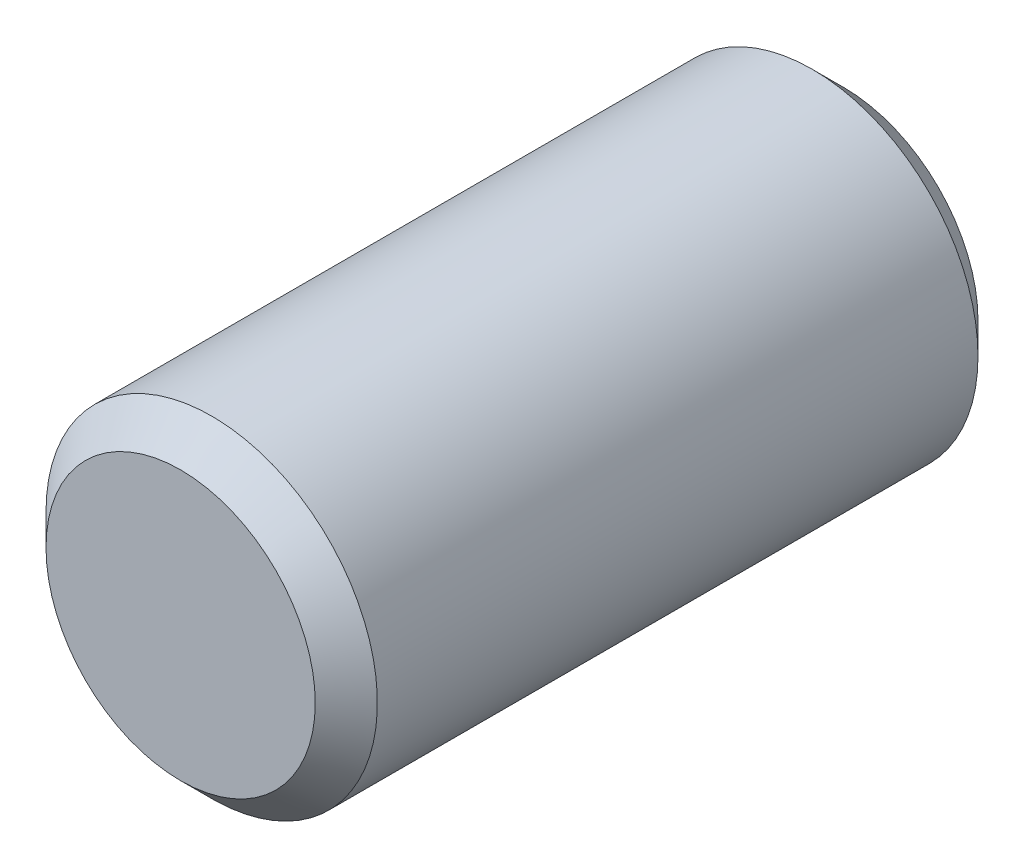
ISO-10303-21;
HEADER;
FILE_DESCRIPTION(('STEP AP214'),'2;1');
FILE_NAME('part.step','',(''),(''),'','','');
FILE_SCHEMA(('AUTOMOTIVE_DESIGN { 1 0 10303 214 1 1 1 1 }'));
ENDSEC;
DATA;
#1=APPLICATION_CONTEXT('core data for automotive mechanical design processes');
#2=APPLICATION_PROTOCOL_DEFINITION('international standard','automotive_design',2000,#1);
#3=PRODUCT_CONTEXT('',#1,'mechanical');
#4=PRODUCT('Part','Part','',(#3));
#5=PRODUCT_RELATED_PRODUCT_CATEGORY('part','',(#4));
#6=PRODUCT_DEFINITION_FORMATION('','',#4);
#7=PRODUCT_DEFINITION_CONTEXT('part definition',#1,'design');
#8=PRODUCT_DEFINITION('design','',#6,#7);
#9=PRODUCT_DEFINITION_SHAPE('','',#8);
#10=(LENGTH_UNIT() NAMED_UNIT(*) SI_UNIT(.MILLI.,.METRE.));
#11=(NAMED_UNIT(*) PLANE_ANGLE_UNIT() SI_UNIT($,.RADIAN.));
#12=(NAMED_UNIT(*) SI_UNIT($,.STERADIAN.) SOLID_ANGLE_UNIT());
#13=UNCERTAINTY_MEASURE_WITH_UNIT(LENGTH_MEASURE(1.E-05),#10,'distance_accuracy_value','');
#14=(GEOMETRIC_REPRESENTATION_CONTEXT(3) GLOBAL_UNCERTAINTY_ASSIGNED_CONTEXT((#13)) GLOBAL_UNIT_ASSIGNED_CONTEXT((#10,
#11,#12)) REPRESENTATION_CONTEXT('',''));
#15=CARTESIAN_POINT('',(0.,0.,0.));
#16=DIRECTION('',(0.,0.,1.));
#17=DIRECTION('',(1.,0.,0.));
#18=AXIS2_PLACEMENT_3D('',#15,#16,#17);
#19=CARTESIAN_POINT('',(0.,0.,32.));
#20=DIRECTION('',(0.,0.,-0.999999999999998));
#21=DIRECTION('',(-0.999999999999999,0.,0.));
#22=AXIS2_PLACEMENT_3D('',#19,#20,#21);
#23=CYLINDRICAL_SURFACE('',#22,8.);
#24=CARTESIAN_POINT('',(0.,0.,30.5));
#25=DIRECTION('',(0.,0.,0.999999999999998));
#26=DIRECTION('',(0.999999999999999,0.,0.));
#27=AXIS2_PLACEMENT_3D('',#24,#25,#26);
#28=CIRCLE('',#27,8.);
#29=CARTESIAN_POINT('',(-8.,0.,30.5));
#30=VERTEX_POINT('',#29);
#31=EDGE_CURVE('E42',#30,#30,#28,.F.);
#32=CARTESIAN_POINT('',(0.,0.,1.5));
#33=DIRECTION('',(0.,0.,0.999999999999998));
#34=DIRECTION('',(0.999999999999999,0.,0.));
#35=AXIS2_PLACEMENT_3D('',#32,#33,#34);
#36=CIRCLE('',#35,8.);
#37=CARTESIAN_POINT('',(-8.,0.,1.5));
#38=VERTEX_POINT('',#37);
#39=EDGE_CURVE('E46',#38,#38,#36,.T.);
#40=CARTESIAN_POINT('',(-8.,0.,30.5));
#41=CARTESIAN_POINT('',(-8.,0.,30.1979166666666));
#42=CARTESIAN_POINT('',(-8.,0.,29.8958333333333));
#43=CARTESIAN_POINT('',(-8.,0.,29.2916666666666));
#44=CARTESIAN_POINT('',(-8.,0.,28.9895833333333));
#45=CARTESIAN_POINT('',(-8.,0.,28.3854166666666));
#46=CARTESIAN_POINT('',(-8.,0.,28.0833333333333));
#47=CARTESIAN_POINT('',(-8.,0.,27.4791666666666));
#48=CARTESIAN_POINT('',(-8.,0.,27.1770833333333));
#49=CARTESIAN_POINT('',(-8.,0.,26.5729166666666));
#50=CARTESIAN_POINT('',(-8.,0.,26.2708333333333));
#51=CARTESIAN_POINT('',(-8.,0.,25.6666666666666));
#52=CARTESIAN_POINT('',(-8.,0.,25.3645833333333));
#53=CARTESIAN_POINT('',(-8.,0.,24.7604166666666));
#54=CARTESIAN_POINT('',(-8.,0.,24.4583333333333));
#55=CARTESIAN_POINT('',(-8.,0.,23.8541666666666));
#56=CARTESIAN_POINT('',(-8.,0.,23.5520833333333));
#57=CARTESIAN_POINT('',(-8.,0.,22.9479166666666));
#58=CARTESIAN_POINT('',(-8.,0.,22.6458333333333));
#59=CARTESIAN_POINT('',(-8.,0.,22.0416666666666));
#60=CARTESIAN_POINT('',(-8.,0.,21.7395833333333));
#61=CARTESIAN_POINT('',(-8.,0.,21.1354166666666));
#62=CARTESIAN_POINT('',(-8.,0.,20.8333333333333));
#63=CARTESIAN_POINT('',(-8.,0.,20.2291666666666));
#64=CARTESIAN_POINT('',(-8.,0.,19.9270833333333));
#65=CARTESIAN_POINT('',(-8.,0.,19.3229166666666));
#66=CARTESIAN_POINT('',(-8.,0.,19.0208333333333));
#67=CARTESIAN_POINT('',(-8.,0.,18.4166666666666));
#68=CARTESIAN_POINT('',(-8.,0.,18.1145833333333));
#69=CARTESIAN_POINT('',(-8.,0.,17.5104166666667));
#70=CARTESIAN_POINT('',(-8.,0.,17.2083333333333));
#71=CARTESIAN_POINT('',(-8.,0.,16.6041666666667));
#72=CARTESIAN_POINT('',(-8.,0.,16.3020833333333));
#73=CARTESIAN_POINT('',(-8.,0.,15.6979166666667));
#74=CARTESIAN_POINT('',(-8.,0.,15.3958333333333));
#75=CARTESIAN_POINT('',(-8.,0.,14.7916666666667));
#76=CARTESIAN_POINT('',(-8.,0.,14.4895833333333));
#77=CARTESIAN_POINT('',(-8.,0.,13.8854166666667));
#78=CARTESIAN_POINT('',(-8.,0.,13.5833333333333));
#79=CARTESIAN_POINT('',(-8.,0.,12.9791666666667));
#80=CARTESIAN_POINT('',(-8.,0.,12.6770833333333));
#81=CARTESIAN_POINT('',(-8.,0.,12.0729166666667));
#82=CARTESIAN_POINT('',(-8.,0.,11.7708333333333));
#83=CARTESIAN_POINT('',(-8.,0.,11.1666666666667));
#84=CARTESIAN_POINT('',(-8.,0.,10.8645833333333));
#85=CARTESIAN_POINT('',(-8.,0.,10.2604166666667));
#86=CARTESIAN_POINT('',(-8.,0.,9.95833333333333));
#87=CARTESIAN_POINT('',(-8.,0.,9.35416666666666));
#88=CARTESIAN_POINT('',(-8.,0.,9.05208333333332));
#89=CARTESIAN_POINT('',(-8.,0.,8.44791666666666));
#90=CARTESIAN_POINT('',(-8.,0.,8.14583333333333));
#91=CARTESIAN_POINT('',(-8.,0.,7.54166666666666));
#92=CARTESIAN_POINT('',(-8.,0.,7.23958333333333));
#93=CARTESIAN_POINT('',(-8.,0.,6.63541666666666));
#94=CARTESIAN_POINT('',(-8.,0.,6.33333333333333));
#95=CARTESIAN_POINT('',(-8.,0.,5.72916666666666));
#96=CARTESIAN_POINT('',(-8.,0.,5.42708333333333));
#97=CARTESIAN_POINT('',(-8.,0.,4.82291666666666));
#98=CARTESIAN_POINT('',(-8.,0.,4.52083333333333));
#99=CARTESIAN_POINT('',(-8.,0.,3.91666666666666));
#100=CARTESIAN_POINT('',(-8.,0.,3.61458333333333));
#101=CARTESIAN_POINT('',(-8.,0.,3.01041666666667));
#102=CARTESIAN_POINT('',(-8.,0.,2.70833333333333));
#103=CARTESIAN_POINT('',(-8.,0.,2.10416666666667));
#104=CARTESIAN_POINT('',(-8.,0.,1.80208333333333));
#105=CARTESIAN_POINT('',(-8.,0.,1.5));
#106=B_SPLINE_CURVE_WITH_KNOTS('',3,(#40,#41,#42,#43,#44,#45,#46,#47,#48,#49,#50,#51,#52,#53,
#54,#55,#56,#57,#58,#59,#60,#61,#62,#63,#64,#65,#66,#67,#68,#69,#70,#71,#72,#73,#74,#75,#76,#77,
#78,#79,#80,#81,#82,#83,#84,#85,#86,#87,#88,#89,#90,#91,#92,#93,#94,#95,#96,#97,#98,#99,#100,
#101,#102,#103,#104,#105),.UNSPECIFIED.,.F.,.F.,(4,2,2,2,2,2,2,2,2,2,2,2,2,2,2,2,2,2,2,2,2,2,2,
2,2,2,2,2,2,2,2,2,4),(0.,0.906250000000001,1.8125,2.71875,3.625,4.53125,5.4375,6.34375,
7.24999999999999,8.15625,9.06249999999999,9.96874999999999,10.875,11.78125,12.6875,13.59375,
14.5,15.40625,16.3125,17.21875,18.125,19.03125,19.9375,20.84375,21.75,22.65625,23.5625,24.46875,
25.375,26.28125,27.1875,28.09375,29.),.UNSPECIFIED.);
#107=EDGE_CURVE('BSEAM36',#30,#38,#106,.T.);
#108=ORIENTED_EDGE('',*,*,#31,.T.);
#109=ORIENTED_EDGE('',*,*,#39,.T.);
#110=ORIENTED_EDGE('',*,*,#107,.T.);
#111=ORIENTED_EDGE('',*,*,#107,.F.);
#112=EDGE_LOOP('',(#108,#110,#109,#111));
#113=FACE_BOUND('',#112,.T.);
#114=ADVANCED_FACE('F36',(#113),#23,.T.);
#115=CARTESIAN_POINT('',(0.,0.,32.));
#116=DIRECTION('',(0.,0.,0.999999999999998));
#117=DIRECTION('',(0.999999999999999,0.,0.));
#118=AXIS2_PLACEMENT_3D('',#115,#116,#117);
#119=PLANE('',#118);
#120=CARTESIAN_POINT('',(0.,0.,32.));
#121=DIRECTION('',(0.,0.,0.999999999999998));
#122=DIRECTION('',(0.999999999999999,0.,0.));
#123=AXIS2_PLACEMENT_3D('',#120,#121,#122);
#124=CIRCLE('',#123,6.5);
#125=CARTESIAN_POINT('',(-6.5,0.,32.));
#126=VERTEX_POINT('',#125);
#127=EDGE_CURVE('E50',#126,#126,#124,.T.);
#128=ORIENTED_EDGE('',*,*,#127,.T.);
#129=EDGE_LOOP('',(#128));
#130=FACE_BOUND('',#129,.T.);
#131=ADVANCED_FACE('F56',(#130),#119,.T.);
#132=CARTESIAN_POINT('',(0.,0.,0.));
#133=DIRECTION('',(0.,0.,0.999999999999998));
#134=DIRECTION('',(0.999999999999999,0.,0.));
#135=AXIS2_PLACEMENT_3D('',#132,#133,#134);
#136=PLANE('',#135);
#137=CARTESIAN_POINT('',(0.,0.,0.));
#138=DIRECTION('',(0.,0.,0.999999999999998));
#139=DIRECTION('',(0.999999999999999,0.,0.));
#140=AXIS2_PLACEMENT_3D('',#137,#138,#139);
#141=CIRCLE('',#140,6.5);
#142=CARTESIAN_POINT('',(6.5,0.,0.));
#143=VERTEX_POINT('',#142);
#144=EDGE_CURVE('E10',#143,#143,#141,.F.);
#145=ORIENTED_EDGE('',*,*,#144,.T.);
#146=EDGE_LOOP('',(#145));
#147=FACE_BOUND('',#146,.T.);
#148=ADVANCED_FACE('F61',(#147),#136,.F.);
#149=CARTESIAN_POINT('',(0.,0.,32.));
#150=DIRECTION('',(0.,0.,-0.999999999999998));
#151=DIRECTION('',(-0.999999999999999,0.,0.));
#152=AXIS2_PLACEMENT_3D('',#149,#150,#151);
#153=CONICAL_SURFACE('',#152,6.5,0.785398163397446);
#154=CARTESIAN_POINT('',(-8.,0.,30.5));
#155=CARTESIAN_POINT('',(-7.984375,0.,30.515625));
#156=CARTESIAN_POINT('',(-7.96875,0.,30.53125));
#157=CARTESIAN_POINT('',(-7.9375,0.,30.5625));
#158=CARTESIAN_POINT('',(-7.921875,0.,30.578125));
#159=CARTESIAN_POINT('',(-7.890625,0.,30.609375));
#160=CARTESIAN_POINT('',(-7.875,0.,30.625));
#161=CARTESIAN_POINT('',(-7.84375,0.,30.65625));
#162=CARTESIAN_POINT('',(-7.828125,0.,30.671875));
#163=CARTESIAN_POINT('',(-7.796875,0.,30.703125));
#164=CARTESIAN_POINT('',(-7.78125,0.,30.71875));
#165=CARTESIAN_POINT('',(-7.75,0.,30.75));
#166=CARTESIAN_POINT('',(-7.734375,0.,30.765625));
#167=CARTESIAN_POINT('',(-7.703125,0.,30.796875));
#168=CARTESIAN_POINT('',(-7.6875,0.,30.8125));
#169=CARTESIAN_POINT('',(-7.65625,0.,30.84375));
#170=CARTESIAN_POINT('',(-7.640625,0.,30.859375));
#171=CARTESIAN_POINT('',(-7.609375,0.,30.890625));
#172=CARTESIAN_POINT('',(-7.59375,0.,30.90625));
#173=CARTESIAN_POINT('',(-7.5625,0.,30.9375));
#174=CARTESIAN_POINT('',(-7.546875,0.,30.953125));
#175=CARTESIAN_POINT('',(-7.515625,0.,30.984375));
#176=CARTESIAN_POINT('',(-7.5,0.,31.));
#177=CARTESIAN_POINT('',(-7.46875,0.,31.03125));
#178=CARTESIAN_POINT('',(-7.453125,0.,31.046875));
#179=CARTESIAN_POINT('',(-7.421875,0.,31.078125));
#180=CARTESIAN_POINT('',(-7.40625,0.,31.09375));
#181=CARTESIAN_POINT('',(-7.375,0.,31.125));
#182=CARTESIAN_POINT('',(-7.359375,0.,31.140625));
#183=CARTESIAN_POINT('',(-7.328125,0.,31.171875));
#184=CARTESIAN_POINT('',(-7.3125,0.,31.1875));
#185=CARTESIAN_POINT('',(-7.28125,0.,31.21875));
#186=CARTESIAN_POINT('',(-7.265625,0.,31.234375));
#187=CARTESIAN_POINT('',(-7.234375,0.,31.265625));
#188=CARTESIAN_POINT('',(-7.21875,0.,31.28125));
#189=CARTESIAN_POINT('',(-7.1875,0.,31.3125));
#190=CARTESIAN_POINT('',(-7.171875,0.,31.328125));
#191=CARTESIAN_POINT('',(-7.140625,0.,31.359375));
#192=CARTESIAN_POINT('',(-7.125,0.,31.375));
#193=CARTESIAN_POINT('',(-7.09375,0.,31.40625));
#194=CARTESIAN_POINT('',(-7.078125,0.,31.421875));
#195=CARTESIAN_POINT('',(-7.046875,0.,31.453125));
#196=CARTESIAN_POINT('',(-7.03125,0.,31.46875));
#197=CARTESIAN_POINT('',(-7.,0.,31.5));
#198=CARTESIAN_POINT('',(-6.984375,0.,31.515625));
#199=CARTESIAN_POINT('',(-6.953125,0.,31.546875));
#200=CARTESIAN_POINT('',(-6.9375,0.,31.5625));
#201=CARTESIAN_POINT('',(-6.90625,0.,31.59375));
#202=CARTESIAN_POINT('',(-6.890625,0.,31.609375));
#203=CARTESIAN_POINT('',(-6.859375,0.,31.640625));
#204=CARTESIAN_POINT('',(-6.84375,0.,31.65625));
#205=CARTESIAN_POINT('',(-6.8125,0.,31.6875));
#206=CARTESIAN_POINT('',(-6.796875,0.,31.703125));
#207=CARTESIAN_POINT('',(-6.765625,0.,31.734375));
#208=CARTESIAN_POINT('',(-6.75,0.,31.75));
#209=CARTESIAN_POINT('',(-6.71875,0.,31.78125));
#210=CARTESIAN_POINT('',(-6.703125,0.,31.796875));
#211=CARTESIAN_POINT('',(-6.671875,0.,31.828125));
#212=CARTESIAN_POINT('',(-6.65625,0.,31.84375));
#213=CARTESIAN_POINT('',(-6.625,0.,31.875));
#214=CARTESIAN_POINT('',(-6.609375,0.,31.890625));
#215=CARTESIAN_POINT('',(-6.578125,0.,31.921875));
#216=CARTESIAN_POINT('',(-6.5625,0.,31.9375));
#217=CARTESIAN_POINT('',(-6.53125,0.,31.96875));
#218=CARTESIAN_POINT('',(-6.515625,0.,31.984375));
#219=CARTESIAN_POINT('',(-6.5,0.,32.));
#220=B_SPLINE_CURVE_WITH_KNOTS('',3,(#154,#155,#156,#157,#158,#159,#160,#161,#162,#163,#164,
#165,#166,#167,#168,#169,#170,#171,#172,#173,#174,#175,#176,#177,#178,#179,#180,#181,#182,#183,
#184,#185,#186,#187,#188,#189,#190,#191,#192,#193,#194,#195,#196,#197,#198,#199,#200,#201,#202,
#203,#204,#205,#206,#207,#208,#209,#210,#211,#212,#213,#214,#215,#216,#217,#218,#219),
.UNSPECIFIED.,.F.,.F.,(4,2,2,2,2,2,2,2,2,2,2,2,2,2,2,2,2,2,2,2,2,2,2,2,2,2,2,2,2,2,2,2,4),(0.,
0.0662912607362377,0.132582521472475,0.198873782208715,0.265165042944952,0.331456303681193,
0.39774756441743,0.46403882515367,0.530330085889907,0.596621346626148,0.662912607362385,
0.729203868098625,0.795495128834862,0.861786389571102,0.92807765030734,0.99436891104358,
1.06066017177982,1.12695143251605,1.19324269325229,1.25953395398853,1.32582521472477,
1.39211647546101,1.45840773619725,1.52469899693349,1.59099025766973,1.65728151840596,
1.7235727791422,1.78986403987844,1.85615530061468,1.92244656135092,1.98873782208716,
2.0550290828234,2.12132034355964),.UNSPECIFIED.);
#221=EDGE_CURVE('BSEAM58',#30,#126,#220,.T.);
#222=ORIENTED_EDGE('',*,*,#31,.F.);
#223=ORIENTED_EDGE('',*,*,#127,.F.);
#224=ORIENTED_EDGE('',*,*,#221,.T.);
#225=ORIENTED_EDGE('',*,*,#221,.F.);
#226=EDGE_LOOP('',(#222,#224,#223,#225));
#227=FACE_BOUND('',#226,.T.);
#228=ADVANCED_FACE('F58',(#227),#153,.T.);
#229=CARTESIAN_POINT('',(0.,0.,1.5));
#230=DIRECTION('',(0.,0.,0.999999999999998));
#231=DIRECTION('',(0.999999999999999,0.,0.));
#232=AXIS2_PLACEMENT_3D('',#229,#230,#231);
#233=CONICAL_SURFACE('',#232,8.,0.78539816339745);
#234=ORIENTED_EDGE('',*,*,#144,.F.);
#235=EDGE_LOOP('',(#234));
#236=FACE_BOUND('',#235,.T.);
#237=ORIENTED_EDGE('',*,*,#39,.F.);
#238=EDGE_LOOP('',(#237));
#239=FACE_BOUND('',#238,.T.);
#240=ADVANCED_FACE('F60',(#236,#239),#233,.T.);
#241=CLOSED_SHELL('',(#114,#131,#148,#228,#240));
#242=MANIFOLD_SOLID_BREP('B2',#241);
#243=ADVANCED_BREP_SHAPE_REPRESENTATION('',(#18,#242),#14);
#244=SHAPE_DEFINITION_REPRESENTATION(#9,#243);
ENDSEC;
END-ISO-10303-21;
